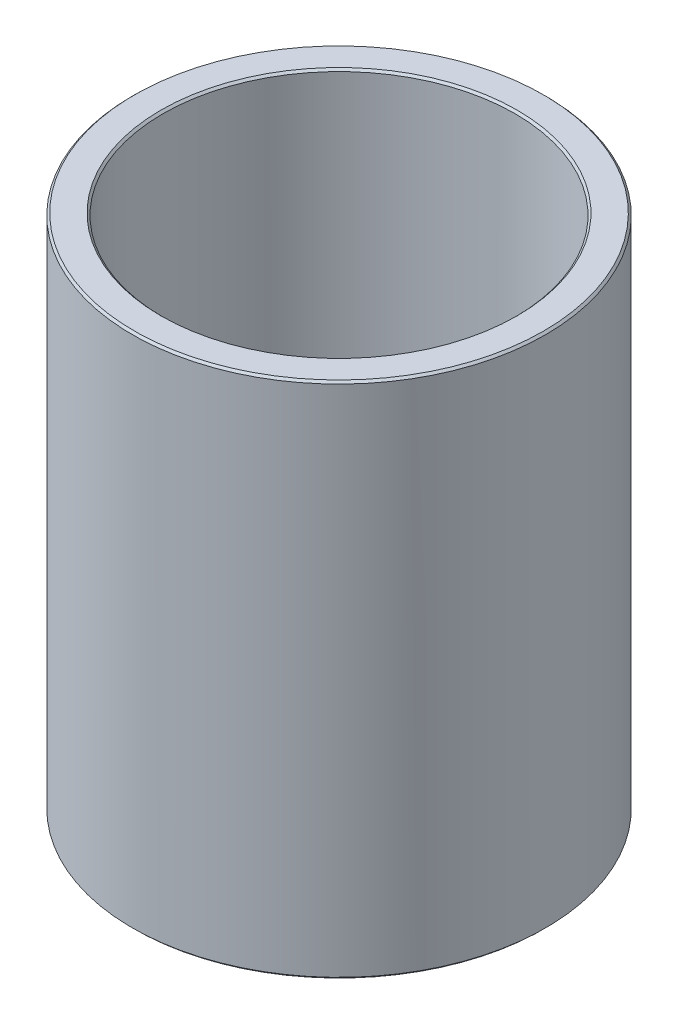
from build123d import *

# Parameters (mm, degrees)
ESQUISSE1_W     = 2.95
ESQUISSE1_H     = 50
CHANFREIN1_SIZE = 0.2


with BuildPart() as part:
    # Esquisse1 → R_volution1 (revolve)
    with BuildSketch(Plane.XY, mode=Mode.PRIVATE) as r_volution1_sk:
        with Locations((18.475, 25)):
            Rectangle(ESQUISSE1_W, ESQUISSE1_H)
    revolve(r_volution1_sk.sketch.rotate(Axis((0, 66.592579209, 0), (0, -1, 0)), 180), axis=Axis((0, 66.592579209, 0), (0, -1, 0)))

    # Chanfrein1
    chanfrein1_edges = [part.edges().sort_by_distance(p)[0] for p in [
        (17, 50, 0),
        (19.95, 50, 0),
        (19.95, 0, 0),
        (17, 0, 0),
    ]]
    chamfer(chanfrein1_edges, length=CHANFREIN1_SIZE)


solid = part.part
